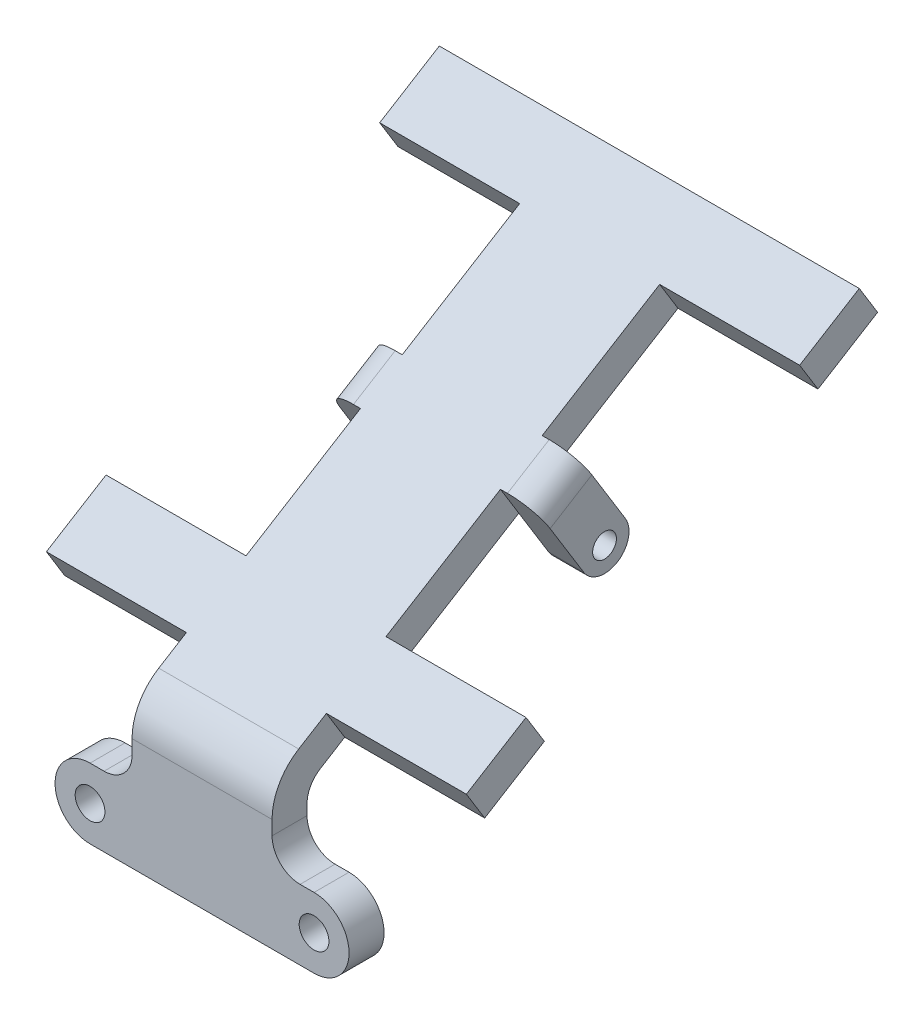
ISO-10303-21;
HEADER;
FILE_DESCRIPTION(('STEP AP214'),'2;1');
FILE_NAME('part.step','',(''),(''),'','','');
FILE_SCHEMA(('AUTOMOTIVE_DESIGN { 1 0 10303 214 1 1 1 1 }'));
ENDSEC;
DATA;
#1=APPLICATION_CONTEXT('core data for automotive mechanical design processes');
#2=APPLICATION_PROTOCOL_DEFINITION('international standard','automotive_design',2000,#1);
#3=PRODUCT_CONTEXT('',#1,'mechanical');
#4=PRODUCT('Part','Part','',(#3));
#5=PRODUCT_RELATED_PRODUCT_CATEGORY('part','',(#4));
#6=PRODUCT_DEFINITION_FORMATION('','',#4);
#7=PRODUCT_DEFINITION_CONTEXT('part definition',#1,'design');
#8=PRODUCT_DEFINITION('design','',#6,#7);
#9=PRODUCT_DEFINITION_SHAPE('','',#8);
#10=(LENGTH_UNIT() NAMED_UNIT(*) SI_UNIT(.MILLI.,.METRE.));
#11=(NAMED_UNIT(*) PLANE_ANGLE_UNIT() SI_UNIT($,.RADIAN.));
#12=(NAMED_UNIT(*) SI_UNIT($,.STERADIAN.) SOLID_ANGLE_UNIT());
#13=UNCERTAINTY_MEASURE_WITH_UNIT(LENGTH_MEASURE(1.E-05),#10,'distance_accuracy_value','');
#14=(GEOMETRIC_REPRESENTATION_CONTEXT(3) GLOBAL_UNCERTAINTY_ASSIGNED_CONTEXT((#13)) GLOBAL_UNIT_ASSIGNED_CONTEXT((#10,
#11,#12)) REPRESENTATION_CONTEXT('',''));
#15=CARTESIAN_POINT('',(0.,0.,0.));
#16=DIRECTION('',(0.,0.,1.));
#17=DIRECTION('',(1.,0.,0.));
#18=AXIS2_PLACEMENT_3D('',#15,#16,#17);
#19=CARTESIAN_POINT('',(-20.,86.6241666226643,10.));
#20=DIRECTION('',(1.,0.,0.));
#21=DIRECTION('',(0.,1.,0.));
#22=AXIS2_PLACEMENT_3D('',#19,#20,#21);
#23=PLANE('',#22);
#24=DIRECTION('',(0.,-0.523670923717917,0.851920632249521));
#25=VECTOR('',#24,1.);
#26=CARTESIAN_POINT('',(-20.,99.6241666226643,10.));
#27=LINE('',#26,#25);
#28=CARTESIAN_POINT('',(-20.,109.165805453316,-5.52257079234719));
#29=VERTEX_POINT('',#28);
#30=CARTESIAN_POINT('',(-20.,104.308916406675,2.37873477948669));
#31=VERTEX_POINT('',#30);
#32=EDGE_CURVE('E440',#29,#31,#27,.T.);
#33=ORIENTED_EDGE('',*,*,#32,.F.);
#34=DIRECTION('',(0.,-0.851920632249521,-0.523670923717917));
#35=VECTOR('',#34,1.);
#36=CARTESIAN_POINT('',(-20.,99.7308115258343,-11.3222096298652));
#37=LINE('',#36,#35);
#38=CARTESIAN_POINT('',(-20.,100.646599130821,-10.7592800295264));
#39=VERTEX_POINT('',#38);
#40=EDGE_CURVE('E361',#29,#39,#37,.T.);
#41=ORIENTED_EDGE('',*,*,#40,.T.);
#42=DIRECTION('',(0.,0.523670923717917,-0.851920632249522));
#43=VECTOR('',#42,1.);
#44=CARTESIAN_POINT('',(-20.,91.1049603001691,4.76329076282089));
#45=LINE('',#44,#43);
#46=CARTESIAN_POINT('',(-20.,96.3753038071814,-3.81063261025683));
#47=VERTEX_POINT('',#46);
#48=EDGE_CURVE('E445',#47,#39,#45,.T.);
#49=ORIENTED_EDGE('',*,*,#48,.F.);
#50=CARTESIAN_POINT('',(-20.,89.5599387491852,-8.00000000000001));
#51=DIRECTION('',(1.,0.,0.));
#52=DIRECTION('',(0.,1.,0.));
#53=AXIS2_PLACEMENT_3D('',#50,#51,#52);
#54=CIRCLE('',#53,8.);
#55=CARTESIAN_POINT('',(-20.,89.5599387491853,0.));
#56=VERTEX_POINT('',#55);
#57=EDGE_CURVE('E537',#47,#56,#54,.T.);
#58=ORIENTED_EDGE('',*,*,#57,.T.);
#59=DIRECTION('',(0.,-1.,0.));
#60=VECTOR('',#59,1.);
#61=CARTESIAN_POINT('',(-20.,86.6241666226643,1.11022302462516E-13));
#62=LINE('',#61,#60);
#63=CARTESIAN_POINT('',(-20.,86.6241666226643,1.11022302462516E-13));
#64=VERTEX_POINT('',#63);
#65=EDGE_CURVE('E482',#56,#64,#62,.T.);
#66=ORIENTED_EDGE('',*,*,#65,.T.);
#67=DIRECTION('',(0.,0.,-1.));
#68=VECTOR('',#67,1.);
#69=CARTESIAN_POINT('',(-20.,86.6241666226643,10.));
#70=LINE('',#69,#68);
#71=CARTESIAN_POINT('',(-20.,86.6241666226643,10.));
#72=VERTEX_POINT('',#71);
#73=EDGE_CURVE('E514',#72,#64,#70,.T.);
#74=ORIENTED_EDGE('',*,*,#73,.F.);
#75=DIRECTION('',(0.,-1.,0.));
#76=VECTOR('',#75,1.);
#77=CARTESIAN_POINT('',(-20.,86.6241666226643,10.));
#78=LINE('',#77,#76);
#79=CARTESIAN_POINT('',(-20.,90.6781862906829,10.));
#80=VERTEX_POINT('',#79);
#81=EDGE_CURVE('E502',#80,#72,#78,.T.);
#82=ORIENTED_EDGE('',*,*,#81,.F.);
#83=CARTESIAN_POINT('',(-20.,90.6781862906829,-6.00000000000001));
#84=DIRECTION('',(1.,0.,0.));
#85=DIRECTION('',(0.,1.,0.));
#86=AXIS2_PLACEMENT_3D('',#83,#84,#85);
#87=CIRCLE('',#86,16.);
#88=EDGE_CURVE('E544',#80,#31,#87,.F.);
#89=ORIENTED_EDGE('',*,*,#88,.T.);
#90=EDGE_LOOP('',(#33,#41,#49,#58,#66,#74,#82,#89));
#91=FACE_BOUND('',#90,.T.);
#92=ADVANCED_FACE('F32',(#91),#23,.F.);
#93=CARTESIAN_POINT('',(20.,86.6241666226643,10.));
#94=DIRECTION('',(-1.,0.,0.));
#95=DIRECTION('',(0.,-1.,0.));
#96=AXIS2_PLACEMENT_3D('',#93,#94,#95);
#97=PLANE('',#96);
#98=DIRECTION('',(0.,0.523670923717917,-0.851920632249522));
#99=VECTOR('',#98,1.);
#100=CARTESIAN_POINT('',(20.,91.104960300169,4.76329076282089));
#101=LINE('',#100,#99);
#102=CARTESIAN_POINT('',(20.,96.3753038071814,-3.81063261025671));
#103=VERTEX_POINT('',#102);
#104=CARTESIAN_POINT('',(20.,100.646599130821,-10.7592800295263));
#105=VERTEX_POINT('',#104);
#106=EDGE_CURVE('E453',#103,#105,#101,.T.);
#107=ORIENTED_EDGE('',*,*,#106,.T.);
#108=DIRECTION('',(0.,0.851920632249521,0.523670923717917));
#109=VECTOR('',#108,1.);
#110=CARTESIAN_POINT('',(20.,99.7308115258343,-11.3222096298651));
#111=LINE('',#110,#109);
#112=CARTESIAN_POINT('',(20.,109.165805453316,-5.52257079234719));
#113=VERTEX_POINT('',#112);
#114=EDGE_CURVE('E359',#105,#113,#111,.T.);
#115=ORIENTED_EDGE('',*,*,#114,.T.);
#116=DIRECTION('',(0.,-0.523670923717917,0.851920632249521));
#117=VECTOR('',#116,1.);
#118=CARTESIAN_POINT('',(20.,99.6241666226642,10.));
#119=LINE('',#118,#117);
#120=CARTESIAN_POINT('',(20.,104.308916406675,2.37873477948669));
#121=VERTEX_POINT('',#120);
#122=EDGE_CURVE('E448',#113,#121,#119,.T.);
#123=ORIENTED_EDGE('',*,*,#122,.T.);
#124=CARTESIAN_POINT('',(20.,90.6781862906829,-6.00000000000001));
#125=DIRECTION('',(-1.,0.,0.));
#126=DIRECTION('',(0.,-1.,0.));
#127=AXIS2_PLACEMENT_3D('',#124,#125,#126);
#128=CIRCLE('',#127,16.);
#129=CARTESIAN_POINT('',(20.,90.6781862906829,10.));
#130=VERTEX_POINT('',#129);
#131=EDGE_CURVE('E550',#121,#130,#128,.F.);
#132=ORIENTED_EDGE('',*,*,#131,.T.);
#133=DIRECTION('',(0.,1.,0.));
#134=VECTOR('',#133,1.);
#135=CARTESIAN_POINT('',(20.,86.6241666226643,10.));
#136=LINE('',#135,#134);
#137=CARTESIAN_POINT('',(20.,86.6241666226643,10.));
#138=VERTEX_POINT('',#137);
#139=EDGE_CURVE('E499',#138,#130,#136,.T.);
#140=ORIENTED_EDGE('',*,*,#139,.F.);
#141=DIRECTION('',(0.,0.,-1.));
#142=VECTOR('',#141,1.);
#143=CARTESIAN_POINT('',(20.,86.6241666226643,10.));
#144=LINE('',#143,#142);
#145=CARTESIAN_POINT('',(20.,86.6241666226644,0.));
#146=VERTEX_POINT('',#145);
#147=EDGE_CURVE('E517',#138,#146,#144,.T.);
#148=ORIENTED_EDGE('',*,*,#147,.T.);
#149=DIRECTION('',(0.,1.,0.));
#150=VECTOR('',#149,1.);
#151=CARTESIAN_POINT('',(20.,86.6241666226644,0.));
#152=LINE('',#151,#150);
#153=CARTESIAN_POINT('',(20.,89.5599387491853,0.));
#154=VERTEX_POINT('',#153);
#155=EDGE_CURVE('E479',#146,#154,#152,.T.);
#156=ORIENTED_EDGE('',*,*,#155,.T.);
#157=CARTESIAN_POINT('',(20.,89.5599387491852,-8.00000000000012));
#158=DIRECTION('',(-1.,0.,0.));
#159=DIRECTION('',(0.,-1.,0.));
#160=AXIS2_PLACEMENT_3D('',#157,#158,#159);
#161=CIRCLE('',#160,8.);
#162=EDGE_CURVE('E539',#154,#103,#161,.T.);
#163=ORIENTED_EDGE('',*,*,#162,.T.);
#164=EDGE_LOOP('',(#107,#115,#123,#132,#140,#148,#156,#163));
#165=FACE_BOUND('',#164,.T.);
#166=ADVANCED_FACE('F610',(#165),#97,.F.);
#167=CARTESIAN_POINT('',(20.,138.5532934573,-72.4268149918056));
#168=VERTEX_POINT('',#167);
#169=CARTESIAN_POINT('',(20.,159.182180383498,-105.986391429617));
#170=VERTEX_POINT('',#169);
#171=EDGE_CURVE('E47',#168,#170,#101,.T.);
#172=ORIENTED_EDGE('',*,*,#171,.T.);
#173=DIRECTION('',(0.,0.851920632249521,0.523670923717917));
#174=VECTOR('',#173,1.);
#175=CARTESIAN_POINT('',(20.0000000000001,158.266392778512,-106.549321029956));
#176=LINE('',#175,#174);
#177=CARTESIAN_POINT('',(20.,167.701386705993,-100.749682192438));
#178=VERTEX_POINT('',#177);
#179=EDGE_CURVE('E51',#170,#178,#176,.T.);
#180=ORIENTED_EDGE('',*,*,#179,.T.);
#181=CARTESIAN_POINT('',(20.,147.072499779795,-67.1901057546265));
#182=VERTEX_POINT('',#181);
#183=EDGE_CURVE('E450',#178,#182,#119,.T.);
#184=ORIENTED_EDGE('',*,*,#183,.T.);
#185=DIRECTION('',(0.,-0.851920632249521,-0.523670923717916));
#186=VECTOR('',#185,1.);
#187=CARTESIAN_POINT('',(19.9999999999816,124.665696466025,-80.9634444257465));
#188=LINE('',#187,#186);
#189=EDGE_CURVE('E374',#182,#168,#188,.T.);
#190=ORIENTED_EDGE('',*,*,#189,.T.);
#191=EDGE_LOOP('',(#172,#180,#184,#190));
#192=FACE_BOUND('',#191,.T.);
#193=ADVANCED_FACE('F684',(#192),#97,.F.);
#194=CARTESIAN_POINT('',(-20.,111.120017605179,-27.7976926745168));
#195=VERTEX_POINT('',#194);
#196=CARTESIAN_POINT('',(-20.,131.221900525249,-60.4999261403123));
#197=VERTEX_POINT('',#196);
#198=EDGE_CURVE('E449',#195,#197,#45,.T.);
#199=ORIENTED_EDGE('',*,*,#198,.F.);
#200=DIRECTION('',(0.,0.851920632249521,0.523670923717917));
#201=VECTOR('',#200,1.);
#202=CARTESIAN_POINT('',(-20.,110.204230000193,-28.3606222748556));
#203=LINE('',#202,#201);
#204=CARTESIAN_POINT('',(-20.,119.639223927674,-22.5609834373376));
#205=VERTEX_POINT('',#204);
#206=EDGE_CURVE('E356',#195,#205,#203,.T.);
#207=ORIENTED_EDGE('',*,*,#206,.T.);
#208=CARTESIAN_POINT('',(-20.,139.741106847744,-55.2632169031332));
#209=VERTEX_POINT('',#208);
#210=EDGE_CURVE('E444',#209,#205,#27,.T.);
#211=ORIENTED_EDGE('',*,*,#210,.F.);
#212=DIRECTION('',(0.,0.851920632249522,0.523670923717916));
#213=VECTOR('',#212,1.);
#214=CARTESIAN_POINT('',(-19.9999999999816,117.334303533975,-69.0365555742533));
#215=LINE('',#214,#213);
#216=EDGE_CURVE('E410',#197,#209,#215,.T.);
#217=ORIENTED_EDGE('',*,*,#216,.F.);
#218=EDGE_LOOP('',(#199,#207,#211,#217));
#219=FACE_BOUND('',#218,.T.);
#220=ADVANCED_FACE('F594',(#219),#23,.F.);
#221=CARTESIAN_POINT('',(-19.9999999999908,167.701386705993,-100.749682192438));
#222=VERTEX_POINT('',#221);
#223=CARTESIAN_POINT('',(-19.9999999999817,147.072499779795,-67.1901057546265));
#224=VERTEX_POINT('',#223);
#225=EDGE_CURVE('E441',#222,#224,#27,.T.);
#226=ORIENTED_EDGE('',*,*,#225,.F.);
#227=DIRECTION('',(0.,-0.851920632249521,-0.523670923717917));
#228=VECTOR('',#227,1.);
#229=CARTESIAN_POINT('',(-20.,158.266392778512,-106.549321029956));
#230=LINE('',#229,#228);
#231=CARTESIAN_POINT('',(-20.,159.182180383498,-105.986391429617));
#232=VERTEX_POINT('',#231);
#233=EDGE_CURVE('E314',#222,#232,#230,.T.);
#234=ORIENTED_EDGE('',*,*,#233,.T.);
#235=CARTESIAN_POINT('',(-19.9999999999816,138.5532934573,-72.4268149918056));
#236=VERTEX_POINT('',#235);
#237=EDGE_CURVE('E443',#236,#232,#45,.T.);
#238=ORIENTED_EDGE('',*,*,#237,.F.);
#239=DIRECTION('',(0.,-0.851920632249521,-0.523670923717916));
#240=VECTOR('',#239,1.);
#241=CARTESIAN_POINT('',(-19.9999999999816,124.665696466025,-80.9634444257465));
#242=LINE('',#241,#240);
#243=EDGE_CURVE('E415',#224,#236,#242,.T.);
#244=ORIENTED_EDGE('',*,*,#243,.F.);
#245=EDGE_LOOP('',(#226,#234,#238,#244));
#246=FACE_BOUND('',#245,.T.);
#247=ADVANCED_FACE('F701',(#246),#23,.F.);
#248=CARTESIAN_POINT('',(-31.9999999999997,68.6241666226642,0.));
#249=DIRECTION('',(0.,0.,1.));
#250=DIRECTION('',(1.,0.,0.));
#251=AXIS2_PLACEMENT_3D('',#248,#249,#250);
#252=PLANE('',#251);
#253=CARTESIAN_POINT('',(31.9999999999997,68.6241666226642,0.));
#254=DIRECTION('',(0.,0.,1.));
#255=DIRECTION('',(1.,0.,0.));
#256=AXIS2_PLACEMENT_3D('',#253,#254,#255);
#257=CIRCLE('',#256,4.25000000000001);
#258=CARTESIAN_POINT('',(36.2499999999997,68.6241666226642,0.));
#259=VERTEX_POINT('',#258);
#260=EDGE_CURVE('E284',#259,#259,#257,.T.);
#261=ORIENTED_EDGE('',*,*,#260,.T.);
#262=EDGE_LOOP('',(#261));
#263=FACE_BOUND('',#262,.T.);
#264=CARTESIAN_POINT('',(-31.9999999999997,68.6241666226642,0.));
#265=DIRECTION('',(0.,0.,1.));
#266=DIRECTION('',(1.,0.,0.));
#267=AXIS2_PLACEMENT_3D('',#264,#265,#266);
#268=CIRCLE('',#267,4.25000000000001);
#269=CARTESIAN_POINT('',(-27.7499999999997,68.6241666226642,0.));
#270=VERTEX_POINT('',#269);
#271=EDGE_CURVE('E462',#270,#270,#268,.T.);
#272=ORIENTED_EDGE('',*,*,#271,.T.);
#273=EDGE_LOOP('',(#272));
#274=FACE_BOUND('',#273,.T.);
#275=ORIENTED_EDGE('',*,*,#65,.F.);
#276=DIRECTION('',(-1.,0.,0.));
#277=VECTOR('',#276,1.);
#278=CARTESIAN_POINT('',(20.,89.5599387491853,0.));
#279=LINE('',#278,#277);
#280=EDGE_CURVE('E535',#56,#154,#279,.F.);
#281=ORIENTED_EDGE('',*,*,#280,.T.);
#282=ORIENTED_EDGE('',*,*,#155,.F.);
#283=CARTESIAN_POINT('',(28.,86.6241666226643,1.11022302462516E-13));
#284=DIRECTION('',(0.,0.,-1.));
#285=DIRECTION('',(-1.,0.,0.));
#286=AXIS2_PLACEMENT_3D('',#283,#284,#285);
#287=CIRCLE('',#286,8.);
#288=CARTESIAN_POINT('',(28.0000000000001,78.6241666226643,-1.11022302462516E-13));
#289=VERTEX_POINT('',#288);
#290=EDGE_CURVE('E477',#289,#146,#287,.T.);
#291=ORIENTED_EDGE('',*,*,#290,.F.);
#292=DIRECTION('',(-1.,0.,0.));
#293=VECTOR('',#292,1.);
#294=CARTESIAN_POINT('',(31.9999999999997,78.6241666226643,0.));
#295=LINE('',#294,#293);
#296=CARTESIAN_POINT('',(31.9999999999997,78.6241666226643,0.));
#297=VERTEX_POINT('',#296);
#298=EDGE_CURVE('E475',#297,#289,#295,.T.);
#299=ORIENTED_EDGE('',*,*,#298,.F.);
#300=CARTESIAN_POINT('',(31.9999999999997,68.6241666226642,0.));
#301=DIRECTION('',(0.,0.,1.));
#302=DIRECTION('',(1.,0.,0.));
#303=AXIS2_PLACEMENT_3D('',#300,#301,#302);
#304=CIRCLE('',#303,9.99999999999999);
#305=CARTESIAN_POINT('',(31.9999999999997,58.6241666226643,0.));
#306=VERTEX_POINT('',#305);
#307=EDGE_CURVE('E473',#306,#297,#304,.T.);
#308=ORIENTED_EDGE('',*,*,#307,.F.);
#309=DIRECTION('',(1.,0.,0.));
#310=VECTOR('',#309,1.);
#311=CARTESIAN_POINT('',(26.4999999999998,58.6241666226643,0.));
#312=LINE('',#311,#310);
#313=CARTESIAN_POINT('',(-31.9999999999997,58.6241666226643,1.11022302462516E-13));
#314=VERTEX_POINT('',#313);
#315=EDGE_CURVE('E471',#314,#306,#312,.T.);
#316=ORIENTED_EDGE('',*,*,#315,.F.);
#317=CARTESIAN_POINT('',(-31.9999999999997,68.6241666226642,0.));
#318=DIRECTION('',(0.,0.,1.));
#319=DIRECTION('',(1.,0.,0.));
#320=AXIS2_PLACEMENT_3D('',#317,#318,#319);
#321=CIRCLE('',#320,9.99999999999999);
#322=CARTESIAN_POINT('',(-31.9999999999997,78.6241666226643,-1.11022302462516E-13));
#323=VERTEX_POINT('',#322);
#324=EDGE_CURVE('E468',#323,#314,#321,.T.);
#325=ORIENTED_EDGE('',*,*,#324,.F.);
#326=DIRECTION('',(-1.,0.,0.));
#327=VECTOR('',#326,1.);
#328=CARTESIAN_POINT('',(-28.0000000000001,78.6241666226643,-1.11022302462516E-13));
#329=LINE('',#328,#327);
#330=CARTESIAN_POINT('',(-28.0000000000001,78.6241666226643,-1.11022302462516E-13));
#331=VERTEX_POINT('',#330);
#332=EDGE_CURVE('E486',#331,#323,#329,.T.);
#333=ORIENTED_EDGE('',*,*,#332,.F.);
#334=CARTESIAN_POINT('',(-28.,86.6241666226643,0.));
#335=DIRECTION('',(0.,0.,-1.));
#336=DIRECTION('',(1.,0.,0.));
#337=AXIS2_PLACEMENT_3D('',#334,#335,#336);
#338=CIRCLE('',#337,8.);
#339=EDGE_CURVE('E484',#64,#331,#338,.T.);
#340=ORIENTED_EDGE('',*,*,#339,.F.);
#341=EDGE_LOOP('',(#275,#281,#282,#291,#299,#308,#316,#325,#333,#340));
#342=FACE_BOUND('',#341,.T.);
#343=ADVANCED_FACE('F625',(#263,#274,#342),#252,.F.);
#344=CARTESIAN_POINT('',(-31.9999999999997,68.6241666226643,9.9999999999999));
#345=DIRECTION('',(0.,0.,1.));
#346=DIRECTION('',(1.,0.,0.));
#347=AXIS2_PLACEMENT_3D('',#344,#345,#346);
#348=PLANE('',#347);
#349=CARTESIAN_POINT('',(-31.9999999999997,68.6241666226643,9.9999999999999));
#350=DIRECTION('',(0.,0.,1.));
#351=DIRECTION('',(1.,0.,0.));
#352=AXIS2_PLACEMENT_3D('',#349,#350,#351);
#353=CIRCLE('',#352,4.25000000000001);
#354=CARTESIAN_POINT('',(-27.7499999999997,68.6241666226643,9.9999999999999));
#355=VERTEX_POINT('',#354);
#356=EDGE_CURVE('E465',#355,#355,#353,.T.);
#357=ORIENTED_EDGE('',*,*,#356,.F.);
#358=EDGE_LOOP('',(#357));
#359=FACE_BOUND('',#358,.T.);
#360=ORIENTED_EDGE('',*,*,#139,.T.);
#361=DIRECTION('',(-1.,0.,0.));
#362=VECTOR('',#361,1.);
#363=CARTESIAN_POINT('',(-20.,90.6781862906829,10.));
#364=LINE('',#363,#362);
#365=EDGE_CURVE('E541',#130,#80,#364,.T.);
#366=ORIENTED_EDGE('',*,*,#365,.T.);
#367=ORIENTED_EDGE('',*,*,#81,.T.);
#368=CARTESIAN_POINT('',(-28.,86.6241666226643,9.9999999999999));
#369=DIRECTION('',(0.,0.,-1.));
#370=DIRECTION('',(1.,0.,0.));
#371=AXIS2_PLACEMENT_3D('',#368,#369,#370);
#372=CIRCLE('',#371,8.);
#373=CARTESIAN_POINT('',(-28.0000000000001,78.6241666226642,10.));
#374=VERTEX_POINT('',#373);
#375=EDGE_CURVE('E504',#72,#374,#372,.T.);
#376=ORIENTED_EDGE('',*,*,#375,.T.);
#377=DIRECTION('',(-1.,0.,0.));
#378=VECTOR('',#377,1.);
#379=CARTESIAN_POINT('',(-28.0000000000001,78.6241666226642,10.));
#380=LINE('',#379,#378);
#381=CARTESIAN_POINT('',(-31.9999999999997,78.6241666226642,10.));
#382=VERTEX_POINT('',#381);
#383=EDGE_CURVE('E506',#374,#382,#380,.T.);
#384=ORIENTED_EDGE('',*,*,#383,.T.);
#385=CARTESIAN_POINT('',(-31.9999999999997,68.6241666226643,9.9999999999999));
#386=DIRECTION('',(0.,0.,1.));
#387=DIRECTION('',(1.,0.,0.));
#388=AXIS2_PLACEMENT_3D('',#385,#386,#387);
#389=CIRCLE('',#388,9.99999999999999);
#390=CARTESIAN_POINT('',(-31.9999999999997,58.6241666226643,10.));
#391=VERTEX_POINT('',#390);
#392=EDGE_CURVE('E488',#382,#391,#389,.T.);
#393=ORIENTED_EDGE('',*,*,#392,.T.);
#394=DIRECTION('',(1.,0.,0.));
#395=VECTOR('',#394,1.);
#396=CARTESIAN_POINT('',(-31.9999999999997,58.6241666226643,10.));
#397=LINE('',#396,#395);
#398=CARTESIAN_POINT('',(31.9999999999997,58.6241666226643,10.));
#399=VERTEX_POINT('',#398);
#400=EDGE_CURVE('E491',#391,#399,#397,.T.);
#401=ORIENTED_EDGE('',*,*,#400,.T.);
#402=CARTESIAN_POINT('',(31.9999999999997,68.6241666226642,9.9999999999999));
#403=DIRECTION('',(0.,0.,1.));
#404=DIRECTION('',(1.,0.,0.));
#405=AXIS2_PLACEMENT_3D('',#402,#403,#404);
#406=CIRCLE('',#405,9.99999999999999);
#407=CARTESIAN_POINT('',(31.9999999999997,78.6241666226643,10.));
#408=VERTEX_POINT('',#407);
#409=EDGE_CURVE('E493',#399,#408,#406,.T.);
#410=ORIENTED_EDGE('',*,*,#409,.T.);
#411=DIRECTION('',(-1.,0.,0.));
#412=VECTOR('',#411,1.);
#413=CARTESIAN_POINT('',(31.9999999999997,78.6241666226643,10.));
#414=LINE('',#413,#412);
#415=CARTESIAN_POINT('',(28.0000000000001,78.6241666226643,10.));
#416=VERTEX_POINT('',#415);
#417=EDGE_CURVE('E495',#408,#416,#414,.T.);
#418=ORIENTED_EDGE('',*,*,#417,.T.);
#419=CARTESIAN_POINT('',(28.,86.6241666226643,10.));
#420=DIRECTION('',(0.,0.,-1.));
#421=DIRECTION('',(-1.,0.,0.));
#422=AXIS2_PLACEMENT_3D('',#419,#420,#421);
#423=CIRCLE('',#422,8.);
#424=EDGE_CURVE('E497',#416,#138,#423,.T.);
#425=ORIENTED_EDGE('',*,*,#424,.T.);
#426=EDGE_LOOP('',(#360,#366,#367,#376,#384,#393,#401,#410,#418,#425));
#427=FACE_BOUND('',#426,.T.);
#428=CARTESIAN_POINT('',(31.9999999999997,68.6241666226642,9.9999999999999));
#429=DIRECTION('',(0.,0.,1.));
#430=DIRECTION('',(1.,0.,0.));
#431=AXIS2_PLACEMENT_3D('',#428,#429,#430);
#432=CIRCLE('',#431,4.25000000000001);
#433=CARTESIAN_POINT('',(36.2499999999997,68.6241666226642,9.9999999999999));
#434=VERTEX_POINT('',#433);
#435=EDGE_CURVE('E459',#434,#434,#432,.T.);
#436=ORIENTED_EDGE('',*,*,#435,.F.);
#437=EDGE_LOOP('',(#436));
#438=FACE_BOUND('',#437,.T.);
#439=ADVANCED_FACE('F612',(#359,#427,#438),#348,.T.);
#440=CARTESIAN_POINT('',(-31.9999999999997,68.6241666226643,9.9999999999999));
#441=DIRECTION('',(0.,0.,-1.));
#442=DIRECTION('',(-1.,0.,0.));
#443=AXIS2_PLACEMENT_3D('',#440,#441,#442);
#444=CYLINDRICAL_SURFACE('',#443,9.99999999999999);
#445=ORIENTED_EDGE('',*,*,#324,.T.);
#446=DIRECTION('',(0.,0.,-1.));
#447=VECTOR('',#446,1.);
#448=CARTESIAN_POINT('',(-31.9999999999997,58.6241666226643,10.));
#449=LINE('',#448,#447);
#450=EDGE_CURVE('E529',#391,#314,#449,.T.);
#451=ORIENTED_EDGE('',*,*,#450,.F.);
#452=ORIENTED_EDGE('',*,*,#392,.F.);
#453=DIRECTION('',(0.,0.,-1.));
#454=VECTOR('',#453,1.);
#455=CARTESIAN_POINT('',(-31.9999999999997,78.6241666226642,10.));
#456=LINE('',#455,#454);
#457=EDGE_CURVE('E508',#382,#323,#456,.T.);
#458=ORIENTED_EDGE('',*,*,#457,.T.);
#459=EDGE_LOOP('',(#445,#451,#452,#458));
#460=FACE_BOUND('',#459,.T.);
#461=ADVANCED_FACE('F34',(#460),#444,.T.);
#462=CARTESIAN_POINT('',(26.4999999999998,58.6241666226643,10.));
#463=DIRECTION('',(0.,1.,0.));
#464=DIRECTION('',(-1.,0.,0.));
#465=AXIS2_PLACEMENT_3D('',#462,#463,#464);
#466=PLANE('',#465);
#467=ORIENTED_EDGE('',*,*,#315,.T.);
#468=DIRECTION('',(0.,0.,-1.));
#469=VECTOR('',#468,1.);
#470=CARTESIAN_POINT('',(31.9999999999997,58.6241666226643,10.));
#471=LINE('',#470,#469);
#472=EDGE_CURVE('E526',#399,#306,#471,.T.);
#473=ORIENTED_EDGE('',*,*,#472,.F.);
#474=ORIENTED_EDGE('',*,*,#400,.F.);
#475=ORIENTED_EDGE('',*,*,#450,.T.);
#476=EDGE_LOOP('',(#467,#473,#474,#475));
#477=FACE_BOUND('',#476,.T.);
#478=ADVANCED_FACE('F747',(#477),#466,.F.);
#479=CARTESIAN_POINT('',(31.9999999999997,68.6241666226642,9.9999999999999));
#480=DIRECTION('',(0.,0.,-1.));
#481=DIRECTION('',(-1.,0.,0.));
#482=AXIS2_PLACEMENT_3D('',#479,#480,#481);
#483=CYLINDRICAL_SURFACE('',#482,9.99999999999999);
#484=ORIENTED_EDGE('',*,*,#307,.T.);
#485=DIRECTION('',(0.,0.,-1.));
#486=VECTOR('',#485,1.);
#487=CARTESIAN_POINT('',(31.9999999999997,78.6241666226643,10.));
#488=LINE('',#487,#486);
#489=EDGE_CURVE('E523',#408,#297,#488,.T.);
#490=ORIENTED_EDGE('',*,*,#489,.F.);
#491=ORIENTED_EDGE('',*,*,#409,.F.);
#492=ORIENTED_EDGE('',*,*,#472,.T.);
#493=EDGE_LOOP('',(#484,#490,#491,#492));
#494=FACE_BOUND('',#493,.T.);
#495=ADVANCED_FACE('F742',(#494),#483,.T.);
#496=CARTESIAN_POINT('',(31.9999999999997,78.6241666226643,10.));
#497=DIRECTION('',(0.,-1.,0.));
#498=DIRECTION('',(0.,0.,-1.));
#499=AXIS2_PLACEMENT_3D('',#496,#497,#498);
#500=PLANE('',#499);
#501=ORIENTED_EDGE('',*,*,#298,.T.);
#502=DIRECTION('',(0.,0.,-1.));
#503=VECTOR('',#502,1.);
#504=CARTESIAN_POINT('',(28.0000000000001,78.6241666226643,10.));
#505=LINE('',#504,#503);
#506=EDGE_CURVE('E520',#416,#289,#505,.T.);
#507=ORIENTED_EDGE('',*,*,#506,.F.);
#508=ORIENTED_EDGE('',*,*,#417,.F.);
#509=ORIENTED_EDGE('',*,*,#489,.T.);
#510=EDGE_LOOP('',(#501,#507,#508,#509));
#511=FACE_BOUND('',#510,.T.);
#512=ADVANCED_FACE('F738',(#511),#500,.F.);
#513=CARTESIAN_POINT('',(28.,86.6241666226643,10.));
#514=DIRECTION('',(0.,0.,-1.));
#515=DIRECTION('',(-1.,0.,0.));
#516=AXIS2_PLACEMENT_3D('',#513,#514,#515);
#517=CYLINDRICAL_SURFACE('',#516,8.);
#518=ORIENTED_EDGE('',*,*,#290,.T.);
#519=ORIENTED_EDGE('',*,*,#147,.F.);
#520=ORIENTED_EDGE('',*,*,#424,.F.);
#521=ORIENTED_EDGE('',*,*,#506,.T.);
#522=EDGE_LOOP('',(#518,#519,#520,#521));
#523=FACE_BOUND('',#522,.T.);
#524=ADVANCED_FACE('F619',(#523),#517,.F.);
#525=CARTESIAN_POINT('',(19.9999999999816,139.741106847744,-55.2632169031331));
#526=VERTEX_POINT('',#525);
#527=CARTESIAN_POINT('',(20.,119.639223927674,-22.5609834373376));
#528=VERTEX_POINT('',#527);
#529=EDGE_CURVE('E452',#526,#528,#119,.T.);
#530=ORIENTED_EDGE('',*,*,#529,.T.);
#531=DIRECTION('',(0.,-0.851920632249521,-0.523670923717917));
#532=VECTOR('',#531,1.);
#533=CARTESIAN_POINT('',(20.,110.204230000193,-28.3606222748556));
#534=LINE('',#533,#532);
#535=CARTESIAN_POINT('',(20.,111.120017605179,-27.7976926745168));
#536=VERTEX_POINT('',#535);
#537=EDGE_CURVE('E353',#528,#536,#534,.T.);
#538=ORIENTED_EDGE('',*,*,#537,.T.);
#539=CARTESIAN_POINT('',(20.,131.221900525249,-60.4999261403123));
#540=VERTEX_POINT('',#539);
#541=EDGE_CURVE('E455',#536,#540,#101,.T.);
#542=ORIENTED_EDGE('',*,*,#541,.T.);
#543=DIRECTION('',(0.,0.851920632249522,0.523670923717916));
#544=VECTOR('',#543,1.);
#545=CARTESIAN_POINT('',(19.9999999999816,117.334303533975,-69.0365555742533));
#546=LINE('',#545,#544);
#547=EDGE_CURVE('E376',#540,#526,#546,.T.);
#548=ORIENTED_EDGE('',*,*,#547,.T.);
#549=EDGE_LOOP('',(#530,#538,#542,#548));
#550=FACE_BOUND('',#549,.T.);
#551=ADVANCED_FACE('F653',(#550),#97,.F.);
#552=CARTESIAN_POINT('',(-28.,86.6241666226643,9.9999999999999));
#553=DIRECTION('',(0.,0.,-1.));
#554=DIRECTION('',(-1.,0.,0.));
#555=AXIS2_PLACEMENT_3D('',#552,#553,#554);
#556=CYLINDRICAL_SURFACE('',#555,8.);
#557=ORIENTED_EDGE('',*,*,#339,.T.);
#558=DIRECTION('',(0.,0.,-1.));
#559=VECTOR('',#558,1.);
#560=CARTESIAN_POINT('',(-28.0000000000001,78.6241666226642,10.));
#561=LINE('',#560,#559);
#562=EDGE_CURVE('E511',#374,#331,#561,.T.);
#563=ORIENTED_EDGE('',*,*,#562,.F.);
#564=ORIENTED_EDGE('',*,*,#375,.F.);
#565=ORIENTED_EDGE('',*,*,#73,.T.);
#566=EDGE_LOOP('',(#557,#563,#564,#565));
#567=FACE_BOUND('',#566,.T.);
#568=ADVANCED_FACE('F731',(#567),#556,.F.);
#569=CARTESIAN_POINT('',(-28.0000000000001,78.6241666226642,10.));
#570=DIRECTION('',(0.,-1.,0.));
#571=DIRECTION('',(0.,0.,-1.));
#572=AXIS2_PLACEMENT_3D('',#569,#570,#571);
#573=PLANE('',#572);
#574=ORIENTED_EDGE('',*,*,#332,.T.);
#575=ORIENTED_EDGE('',*,*,#457,.F.);
#576=ORIENTED_EDGE('',*,*,#383,.F.);
#577=ORIENTED_EDGE('',*,*,#562,.T.);
#578=EDGE_LOOP('',(#574,#575,#576,#577));
#579=FACE_BOUND('',#578,.T.);
#580=ADVANCED_FACE('F736',(#579),#573,.F.);
#581=CARTESIAN_POINT('',(-31.9999999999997,68.6241666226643,9.9999999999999));
#582=DIRECTION('',(0.,0.,-1.));
#583=DIRECTION('',(-1.,0.,0.));
#584=AXIS2_PLACEMENT_3D('',#581,#582,#583);
#585=CYLINDRICAL_SURFACE('',#584,4.25000000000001);
#586=ORIENTED_EDGE('',*,*,#356,.T.);
#587=EDGE_LOOP('',(#586));
#588=FACE_BOUND('',#587,.T.);
#589=ORIENTED_EDGE('',*,*,#271,.F.);
#590=EDGE_LOOP('',(#589));
#591=FACE_BOUND('',#590,.T.);
#592=ADVANCED_FACE('F840',(#588,#591),#585,.F.);
#593=CARTESIAN_POINT('',(31.9999999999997,68.6241666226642,9.9999999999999));
#594=DIRECTION('',(0.,0.,-1.));
#595=DIRECTION('',(-1.,0.,0.));
#596=AXIS2_PLACEMENT_3D('',#593,#594,#595);
#597=CYLINDRICAL_SURFACE('',#596,4.25000000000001);
#598=ORIENTED_EDGE('',*,*,#435,.T.);
#599=EDGE_LOOP('',(#598));
#600=FACE_BOUND('',#599,.T.);
#601=ORIENTED_EDGE('',*,*,#260,.F.);
#602=EDGE_LOOP('',(#601));
#603=FACE_BOUND('',#602,.T.);
#604=ADVANCED_FACE('F833',(#600,#603),#597,.F.);
#605=CARTESIAN_POINT('',(20.,91.104960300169,4.76329076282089));
#606=DIRECTION('',(0.,0.851920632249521,0.523670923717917));
#607=DIRECTION('',(0.,-0.523670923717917,0.851920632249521));
#608=AXIS2_PLACEMENT_3D('',#605,#606,#607);
#609=PLANE('',#608);
#610=ORIENTED_EDGE('',*,*,#237,.T.);
#611=DIRECTION('',(-1.,0.,0.));
#612=VECTOR('',#611,1.);
#613=CARTESIAN_POINT('',(60.,159.182180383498,-105.986391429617));
#614=LINE('',#613,#612);
#615=CARTESIAN_POINT('',(-60.,159.182180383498,-105.986391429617));
#616=VERTEX_POINT('',#615);
#617=EDGE_CURVE('E689',#232,#616,#614,.T.);
#618=ORIENTED_EDGE('',*,*,#617,.T.);
#619=DIRECTION('',(0.,0.523670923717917,-0.851920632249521));
#620=VECTOR('',#619,1.);
#621=CARTESIAN_POINT('',(-60.,159.182180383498,-105.986391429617));
#622=LINE('',#621,#620);
#623=CARTESIAN_POINT('',(-60.,169.655598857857,-123.024804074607));
#624=VERTEX_POINT('',#623);
#625=EDGE_CURVE('E310',#616,#624,#622,.T.);
#626=ORIENTED_EDGE('',*,*,#625,.T.);
#627=DIRECTION('',(-1.,0.,0.));
#628=VECTOR('',#627,1.);
#629=CARTESIAN_POINT('',(20.,169.655598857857,-123.024804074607));
#630=LINE('',#629,#628);
#631=CARTESIAN_POINT('',(60.,169.655598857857,-123.024804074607));
#632=VERTEX_POINT('',#631);
#633=EDGE_CURVE('E285',#632,#624,#630,.T.);
#634=ORIENTED_EDGE('',*,*,#633,.F.);
#635=DIRECTION('',(0.,-0.523670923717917,0.851920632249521));
#636=VECTOR('',#635,1.);
#637=CARTESIAN_POINT('',(60.,159.182180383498,-105.986391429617));
#638=LINE('',#637,#636);
#639=CARTESIAN_POINT('',(60.,159.182180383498,-105.986391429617));
#640=VERTEX_POINT('',#639);
#641=EDGE_CURVE('E293',#632,#640,#638,.T.);
#642=ORIENTED_EDGE('',*,*,#641,.T.);
#643=EDGE_CURVE('E688',#640,#170,#614,.T.);
#644=ORIENTED_EDGE('',*,*,#643,.T.);
#645=ORIENTED_EDGE('',*,*,#171,.F.);
#646=DIRECTION('',(0.,0.523670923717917,-0.851920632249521));
#647=VECTOR('',#646,1.);
#648=CARTESIAN_POINT('',(19.9999999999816,91.104960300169,4.76329076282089));
#649=LINE('',#648,#647);
#650=EDGE_CURVE('E398',#540,#168,#649,.T.);
#651=ORIENTED_EDGE('',*,*,#650,.F.);
#652=ORIENTED_EDGE('',*,*,#541,.F.);
#653=DIRECTION('',(1.,0.,0.));
#654=VECTOR('',#653,1.);
#655=CARTESIAN_POINT('',(60.,111.120017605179,-27.7976926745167));
#656=LINE('',#655,#654);
#657=CARTESIAN_POINT('',(60.,111.120017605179,-27.7976926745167));
#658=VERTEX_POINT('',#657);
#659=EDGE_CURVE('E328',#536,#658,#656,.T.);
#660=ORIENTED_EDGE('',*,*,#659,.T.);
#661=DIRECTION('',(0.,-0.523670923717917,0.851920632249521));
#662=VECTOR('',#661,1.);
#663=CARTESIAN_POINT('',(60.,100.646599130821,-10.7592800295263));
#664=LINE('',#663,#662);
#665=CARTESIAN_POINT('',(60.,100.646599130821,-10.7592800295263));
#666=VERTEX_POINT('',#665);
#667=EDGE_CURVE('E326',#658,#666,#664,.T.);
#668=ORIENTED_EDGE('',*,*,#667,.T.);
#669=DIRECTION('',(-1.,0.,0.));
#670=VECTOR('',#669,1.);
#671=CARTESIAN_POINT('',(60.,100.646599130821,-10.7592800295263));
#672=LINE('',#671,#670);
#673=EDGE_CURVE('E323',#666,#105,#672,.T.);
#674=ORIENTED_EDGE('',*,*,#673,.T.);
#675=ORIENTED_EDGE('',*,*,#106,.F.);
#676=DIRECTION('',(-1.,0.,0.));
#677=VECTOR('',#676,1.);
#678=CARTESIAN_POINT('',(-20.,96.3753038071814,-3.81063261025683));
#679=LINE('',#678,#677);
#680=EDGE_CURVE('E532',#103,#47,#679,.T.);
#681=ORIENTED_EDGE('',*,*,#680,.T.);
#682=ORIENTED_EDGE('',*,*,#48,.T.);
#683=CARTESIAN_POINT('',(-60.,100.646599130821,-10.7592800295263));
#684=VERTEX_POINT('',#683);
#685=EDGE_CURVE('E321',#39,#684,#672,.T.);
#686=ORIENTED_EDGE('',*,*,#685,.T.);
#687=DIRECTION('',(0.,0.523670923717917,-0.851920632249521));
#688=VECTOR('',#687,1.);
#689=CARTESIAN_POINT('',(-60.,100.646599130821,-10.7592800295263));
#690=LINE('',#689,#688);
#691=CARTESIAN_POINT('',(-60.,111.120017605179,-27.7976926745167));
#692=VERTEX_POINT('',#691);
#693=EDGE_CURVE('E319',#684,#692,#690,.T.);
#694=ORIENTED_EDGE('',*,*,#693,.T.);
#695=EDGE_CURVE('E351',#692,#195,#656,.T.);
#696=ORIENTED_EDGE('',*,*,#695,.T.);
#697=ORIENTED_EDGE('',*,*,#198,.T.);
#698=DIRECTION('',(0.,-0.523670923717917,0.851920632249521));
#699=VECTOR('',#698,1.);
#700=CARTESIAN_POINT('',(-19.9999999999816,91.1049603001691,4.76329076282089));
#701=LINE('',#700,#699);
#702=EDGE_CURVE('E437',#236,#197,#701,.T.);
#703=ORIENTED_EDGE('',*,*,#702,.F.);
#704=EDGE_LOOP('',(#610,#618,#626,#634,#642,#644,#645,#651,#652,#660,#668,#674,#675,#681,#682,
#686,#694,#696,#697,#703));
#705=FACE_BOUND('',#704,.T.);
#706=ADVANCED_FACE('F636',(#705),#609,.F.);
#707=CARTESIAN_POINT('',(20.,169.655598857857,-123.024804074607));
#708=DIRECTION('',(0.,-0.523670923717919,0.85192063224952));
#709=DIRECTION('',(0.,-0.85192063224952,-0.523670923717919));
#710=AXIS2_PLACEMENT_3D('',#707,#708,#709);
#711=PLANE('',#710);
#712=ORIENTED_EDGE('',*,*,#633,.T.);
#713=DIRECTION('',(0.,0.851920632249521,0.523670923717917));
#714=VECTOR('',#713,1.);
#715=CARTESIAN_POINT('',(-60.,66.0149808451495,-186.732121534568));
#716=LINE('',#715,#714);
#717=CARTESIAN_POINT('',(-60.,178.174805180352,-117.788094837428));
#718=VERTEX_POINT('',#717);
#719=EDGE_CURVE('E279',#624,#718,#716,.T.);
#720=ORIENTED_EDGE('',*,*,#719,.T.);
#721=DIRECTION('',(-1.,0.,0.));
#722=VECTOR('',#721,1.);
#723=CARTESIAN_POINT('',(20.,178.174805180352,-117.788094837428));
#724=LINE('',#723,#722);
#725=CARTESIAN_POINT('',(60.,178.174805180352,-117.788094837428));
#726=VERTEX_POINT('',#725);
#727=EDGE_CURVE('E274',#726,#718,#724,.T.);
#728=ORIENTED_EDGE('',*,*,#727,.F.);
#729=DIRECTION('',(0.,0.851920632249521,0.523670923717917));
#730=VECTOR('',#729,1.);
#731=CARTESIAN_POINT('',(60.,66.0149808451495,-186.732121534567));
#732=LINE('',#731,#730);
#733=EDGE_CURVE('E277',#632,#726,#732,.T.);
#734=ORIENTED_EDGE('',*,*,#733,.F.);
#735=EDGE_LOOP('',(#712,#720,#728,#734));
#736=FACE_BOUND('',#735,.T.);
#737=ADVANCED_FACE('F276',(#736),#711,.F.);
#738=CARTESIAN_POINT('',(20.,99.6241666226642,10.));
#739=DIRECTION('',(0.,-0.851920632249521,-0.523670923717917));
#740=DIRECTION('',(0.,0.523670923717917,-0.851920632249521));
#741=AXIS2_PLACEMENT_3D('',#738,#739,#740);
#742=PLANE('',#741);
#743=ORIENTED_EDGE('',*,*,#183,.F.);
#744=DIRECTION('',(1.,0.,0.));
#745=VECTOR('',#744,1.);
#746=CARTESIAN_POINT('',(60.,167.701386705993,-100.749682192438));
#747=LINE('',#746,#745);
#748=CARTESIAN_POINT('',(60.,167.701386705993,-100.749682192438));
#749=VERTEX_POINT('',#748);
#750=EDGE_CURVE('E298',#178,#749,#747,.T.);
#751=ORIENTED_EDGE('',*,*,#750,.T.);
#752=DIRECTION('',(0.,0.523670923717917,-0.851920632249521));
#753=VECTOR('',#752,1.);
#754=CARTESIAN_POINT('',(60.,167.701386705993,-100.749682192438));
#755=LINE('',#754,#753);
#756=EDGE_CURVE('E292',#749,#726,#755,.T.);
#757=ORIENTED_EDGE('',*,*,#756,.T.);
#758=ORIENTED_EDGE('',*,*,#727,.T.);
#759=DIRECTION('',(0.,-0.523670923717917,0.851920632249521));
#760=VECTOR('',#759,1.);
#761=CARTESIAN_POINT('',(-60.,167.701386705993,-100.749682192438));
#762=LINE('',#761,#760);
#763=CARTESIAN_POINT('',(-60.,167.701386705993,-100.749682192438));
#764=VERTEX_POINT('',#763);
#765=EDGE_CURVE('E300',#718,#764,#762,.T.);
#766=ORIENTED_EDGE('',*,*,#765,.T.);
#767=EDGE_CURVE('E294',#764,#222,#747,.T.);
#768=ORIENTED_EDGE('',*,*,#767,.T.);
#769=ORIENTED_EDGE('',*,*,#225,.T.);
#770=DIRECTION('',(1.,0.,0.));
#771=VECTOR('',#770,1.);
#772=CARTESIAN_POINT('',(-29.9999999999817,147.072499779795,-67.1901057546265));
#773=LINE('',#772,#771);
#774=CARTESIAN_POINT('',(-21.9999999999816,147.072499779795,-67.1901057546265));
#775=VERTEX_POINT('',#774);
#776=EDGE_CURVE('E429',#775,#224,#773,.T.);
#777=ORIENTED_EDGE('',*,*,#776,.F.);
#778=DIRECTION('',(0.,0.523670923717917,-0.851920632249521));
#779=VECTOR('',#778,1.);
#780=CARTESIAN_POINT('',(-21.9999999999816,139.741106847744,-55.2632169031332));
#781=LINE('',#780,#779);
#782=CARTESIAN_POINT('',(-21.9999999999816,139.741106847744,-55.2632169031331));
#783=VERTEX_POINT('',#782);
#784=EDGE_CURVE('E552',#775,#783,#781,.F.);
#785=ORIENTED_EDGE('',*,*,#784,.T.);
#786=DIRECTION('',(1.,0.,0.));
#787=VECTOR('',#786,1.);
#788=CARTESIAN_POINT('',(-29.9999999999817,139.741106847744,-55.2632169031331));
#789=LINE('',#788,#787);
#790=EDGE_CURVE('E432',#783,#209,#789,.T.);
#791=ORIENTED_EDGE('',*,*,#790,.T.);
#792=ORIENTED_EDGE('',*,*,#210,.T.);
#793=DIRECTION('',(-1.,0.,0.));
#794=VECTOR('',#793,1.);
#795=CARTESIAN_POINT('',(60.,119.639223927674,-22.5609834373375));
#796=LINE('',#795,#794);
#797=CARTESIAN_POINT('',(-60.,119.639223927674,-22.5609834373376));
#798=VERTEX_POINT('',#797);
#799=EDGE_CURVE('E331',#205,#798,#796,.T.);
#800=ORIENTED_EDGE('',*,*,#799,.T.);
#801=DIRECTION('',(0.,-0.523670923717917,0.851920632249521));
#802=VECTOR('',#801,1.);
#803=CARTESIAN_POINT('',(-60.,109.165805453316,-5.52257079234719));
#804=LINE('',#803,#802);
#805=CARTESIAN_POINT('',(-60.,109.165805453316,-5.52257079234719));
#806=VERTEX_POINT('',#805);
#807=EDGE_CURVE('E335',#798,#806,#804,.T.);
#808=ORIENTED_EDGE('',*,*,#807,.T.);
#809=DIRECTION('',(1.,0.,0.));
#810=VECTOR('',#809,1.);
#811=CARTESIAN_POINT('',(60.,109.165805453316,-5.52257079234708));
#812=LINE('',#811,#810);
#813=EDGE_CURVE('E339',#806,#29,#812,.T.);
#814=ORIENTED_EDGE('',*,*,#813,.T.);
#815=ORIENTED_EDGE('',*,*,#32,.T.);
#816=DIRECTION('',(-1.,0.,0.));
#817=VECTOR('',#816,1.);
#818=CARTESIAN_POINT('',(20.,104.308916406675,2.37873477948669));
#819=LINE('',#818,#817);
#820=EDGE_CURVE('E547',#31,#121,#819,.F.);
#821=ORIENTED_EDGE('',*,*,#820,.T.);
#822=ORIENTED_EDGE('',*,*,#122,.F.);
#823=CARTESIAN_POINT('',(60.,109.165805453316,-5.52257079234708));
#824=VERTEX_POINT('',#823);
#825=EDGE_CURVE('E338',#113,#824,#812,.T.);
#826=ORIENTED_EDGE('',*,*,#825,.T.);
#827=DIRECTION('',(0.,0.523670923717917,-0.851920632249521));
#828=VECTOR('',#827,1.);
#829=CARTESIAN_POINT('',(60.,109.165805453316,-5.52257079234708));
#830=LINE('',#829,#828);
#831=CARTESIAN_POINT('',(60.,119.639223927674,-22.5609834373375));
#832=VERTEX_POINT('',#831);
#833=EDGE_CURVE('E318',#824,#832,#830,.T.);
#834=ORIENTED_EDGE('',*,*,#833,.T.);
#835=EDGE_CURVE('E332',#832,#528,#796,.T.);
#836=ORIENTED_EDGE('',*,*,#835,.T.);
#837=ORIENTED_EDGE('',*,*,#529,.F.);
#838=DIRECTION('',(-1.,0.,0.));
#839=VECTOR('',#838,1.);
#840=CARTESIAN_POINT('',(29.9999999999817,139.741106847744,-55.2632169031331));
#841=LINE('',#840,#839);
#842=CARTESIAN_POINT('',(21.9999999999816,139.741106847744,-55.2632169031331));
#843=VERTEX_POINT('',#842);
#844=EDGE_CURVE('E390',#843,#526,#841,.T.);
#845=ORIENTED_EDGE('',*,*,#844,.F.);
#846=DIRECTION('',(0.,0.523670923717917,-0.851920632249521));
#847=VECTOR('',#846,1.);
#848=CARTESIAN_POINT('',(21.9999999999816,147.072499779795,-67.1901057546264));
#849=LINE('',#848,#847);
#850=CARTESIAN_POINT('',(21.9999999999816,147.072499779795,-67.1901057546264));
#851=VERTEX_POINT('',#850);
#852=EDGE_CURVE('E554',#843,#851,#849,.T.);
#853=ORIENTED_EDGE('',*,*,#852,.T.);
#854=DIRECTION('',(-1.,0.,0.));
#855=VECTOR('',#854,1.);
#856=CARTESIAN_POINT('',(29.9999999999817,147.072499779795,-67.1901057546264));
#857=LINE('',#856,#855);
#858=EDGE_CURVE('E392',#851,#182,#857,.T.);
#859=ORIENTED_EDGE('',*,*,#858,.T.);
#860=EDGE_LOOP('',(#743,#751,#757,#758,#766,#768,#769,#777,#785,#791,#792,#800,#808,#814,#815,
#821,#822,#826,#834,#836,#837,#845,#853,#859));
#861=FACE_BOUND('',#860,.T.);
#862=ADVANCED_FACE('F296',(#861),#742,.F.);
#863=CARTESIAN_POINT('',(20.,89.5599387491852,-8.00000000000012));
#864=DIRECTION('',(1.,0.,0.));
#865=DIRECTION('',(0.,0.,-1.));
#866=AXIS2_PLACEMENT_3D('',#863,#864,#865);
#867=CYLINDRICAL_SURFACE('',#866,8.);
#868=ORIENTED_EDGE('',*,*,#162,.F.);
#869=ORIENTED_EDGE('',*,*,#280,.F.);
#870=ORIENTED_EDGE('',*,*,#57,.F.);
#871=ORIENTED_EDGE('',*,*,#680,.F.);
#872=EDGE_LOOP('',(#868,#869,#870,#871));
#873=FACE_BOUND('',#872,.T.);
#874=ADVANCED_FACE('F630',(#873),#867,.F.);
#875=CARTESIAN_POINT('',(-31.9999999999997,90.6781862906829,-6.00000000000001));
#876=DIRECTION('',(1.,0.,0.));
#877=DIRECTION('',(0.,0.,-1.));
#878=AXIS2_PLACEMENT_3D('',#875,#876,#877);
#879=CYLINDRICAL_SURFACE('',#878,16.);
#880=ORIENTED_EDGE('',*,*,#131,.F.);
#881=ORIENTED_EDGE('',*,*,#820,.F.);
#882=ORIENTED_EDGE('',*,*,#88,.F.);
#883=ORIENTED_EDGE('',*,*,#365,.F.);
#884=EDGE_LOOP('',(#880,#881,#882,#883));
#885=FACE_BOUND('',#884,.T.);
#886=ADVANCED_FACE('F607',(#885),#879,.T.);
#887=CARTESIAN_POINT('',(-19.9999999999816,121.,-75.0000000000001));
#888=DIRECTION('',(-1.,0.,0.));
#889=DIRECTION('',(0.,-1.,0.));
#890=AXIS2_PLACEMENT_3D('',#887,#888,#889);
#891=PLANE('',#890);
#892=CARTESIAN_POINT('',(-19.9999999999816,121.,-75.0000000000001));
#893=DIRECTION('',(-1.,0.,0.));
#894=DIRECTION('',(0.,-1.,0.));
#895=AXIS2_PLACEMENT_3D('',#892,#893,#894);
#896=CIRCLE('',#895,3.4);
#897=CARTESIAN_POINT('',(-19.9999999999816,117.6,-75.0000000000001));
#898=VERTEX_POINT('',#897);
#899=EDGE_CURVE('E401',#898,#898,#896,.T.);
#900=ORIENTED_EDGE('',*,*,#899,.T.);
#901=EDGE_LOOP('',(#900));
#902=FACE_BOUND('',#901,.T.);
#903=CARTESIAN_POINT('',(-19.9999999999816,124.665696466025,-80.9634444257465));
#904=VERTEX_POINT('',#903);
#905=EDGE_CURVE('E414',#236,#904,#242,.T.);
#906=ORIENTED_EDGE('',*,*,#905,.F.);
#907=ORIENTED_EDGE('',*,*,#702,.T.);
#908=CARTESIAN_POINT('',(-19.9999999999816,117.334303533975,-69.0365555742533));
#909=VERTEX_POINT('',#908);
#910=EDGE_CURVE('E411',#909,#197,#215,.T.);
#911=ORIENTED_EDGE('',*,*,#910,.F.);
#912=CARTESIAN_POINT('',(-19.9999999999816,121.,-75.0000000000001));
#913=DIRECTION('',(-1.,0.,0.));
#914=DIRECTION('',(0.,-1.,0.));
#915=AXIS2_PLACEMENT_3D('',#912,#913,#914);
#916=CIRCLE('',#915,7.00000000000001);
#917=EDGE_CURVE('E407',#904,#909,#916,.T.);
#918=ORIENTED_EDGE('',*,*,#917,.F.);
#919=EDGE_LOOP('',(#906,#907,#911,#918));
#920=FACE_BOUND('',#919,.T.);
#921=ADVANCED_FACE('F704',(#902,#920),#891,.F.);
#922=CARTESIAN_POINT('',(-29.9999999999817,121.,-75.));
#923=DIRECTION('',(-1.,0.,0.));
#924=DIRECTION('',(0.,-1.,0.));
#925=AXIS2_PLACEMENT_3D('',#922,#923,#924);
#926=PLANE('',#925);
#927=DIRECTION('',(0.,0.851920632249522,0.523670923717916));
#928=VECTOR('',#927,1.);
#929=CARTESIAN_POINT('',(-29.9999999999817,117.334303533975,-69.0365555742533));
#930=LINE('',#929,#928);
#931=CARTESIAN_POINT('',(-29.9999999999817,117.334303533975,-69.0365555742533));
#932=VERTEX_POINT('',#931);
#933=CARTESIAN_POINT('',(-29.9999999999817,132.925741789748,-59.4525842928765));
#934=VERTEX_POINT('',#933);
#935=EDGE_CURVE('E421',#932,#934,#930,.T.);
#936=ORIENTED_EDGE('',*,*,#935,.T.);
#937=DIRECTION('',(0.,0.523670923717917,-0.851920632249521));
#938=VECTOR('',#937,1.);
#939=CARTESIAN_POINT('',(-29.9999999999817,140.257134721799,-71.3794731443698));
#940=LINE('',#939,#938);
#941=CARTESIAN_POINT('',(-29.9999999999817,140.257134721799,-71.3794731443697));
#942=VERTEX_POINT('',#941);
#943=EDGE_CURVE('E563',#934,#942,#940,.T.);
#944=ORIENTED_EDGE('',*,*,#943,.T.);
#945=DIRECTION('',(0.,-0.851920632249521,-0.523670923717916));
#946=VECTOR('',#945,1.);
#947=CARTESIAN_POINT('',(-29.9999999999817,124.665696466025,-80.9634444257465));
#948=LINE('',#947,#946);
#949=CARTESIAN_POINT('',(-29.9999999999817,124.665696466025,-80.9634444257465));
#950=VERTEX_POINT('',#949);
#951=EDGE_CURVE('E424',#942,#950,#948,.T.);
#952=ORIENTED_EDGE('',*,*,#951,.T.);
#953=CARTESIAN_POINT('',(-29.9999999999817,121.,-75.));
#954=DIRECTION('',(-1.,0.,0.));
#955=DIRECTION('',(0.,-1.,0.));
#956=AXIS2_PLACEMENT_3D('',#953,#954,#955);
#957=CIRCLE('',#956,7.00000000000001);
#958=EDGE_CURVE('E418',#950,#932,#957,.T.);
#959=ORIENTED_EDGE('',*,*,#958,.T.);
#960=EDGE_LOOP('',(#936,#944,#952,#959));
#961=FACE_BOUND('',#960,.T.);
#962=CARTESIAN_POINT('',(-29.9999999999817,121.,-75.));
#963=DIRECTION('',(-1.,0.,0.));
#964=DIRECTION('',(0.,-1.,0.));
#965=AXIS2_PLACEMENT_3D('',#962,#963,#964);
#966=CIRCLE('',#965,3.4);
#967=CARTESIAN_POINT('',(-29.9999999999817,117.6,-75.));
#968=VERTEX_POINT('',#967);
#969=EDGE_CURVE('E404',#968,#968,#966,.T.);
#970=ORIENTED_EDGE('',*,*,#969,.F.);
#971=EDGE_LOOP('',(#970));
#972=FACE_BOUND('',#971,.T.);
#973=ADVANCED_FACE('F582',(#961,#972),#926,.T.);
#974=CARTESIAN_POINT('',(-29.9999999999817,121.,-75.));
#975=DIRECTION('',(1.,0.,0.));
#976=DIRECTION('',(0.,1.,0.));
#977=AXIS2_PLACEMENT_3D('',#974,#975,#976);
#978=CYLINDRICAL_SURFACE('',#977,7.00000000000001);
#979=ORIENTED_EDGE('',*,*,#917,.T.);
#980=DIRECTION('',(1.,0.,0.));
#981=VECTOR('',#980,1.);
#982=CARTESIAN_POINT('',(-29.9999999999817,117.334303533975,-69.0365555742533));
#983=LINE('',#982,#981);
#984=EDGE_CURVE('E434',#932,#909,#983,.T.);
#985=ORIENTED_EDGE('',*,*,#984,.F.);
#986=ORIENTED_EDGE('',*,*,#958,.F.);
#987=DIRECTION('',(1.,0.,0.));
#988=VECTOR('',#987,1.);
#989=CARTESIAN_POINT('',(-29.9999999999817,124.665696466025,-80.9634444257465));
#990=LINE('',#989,#988);
#991=EDGE_CURVE('E426',#950,#904,#990,.T.);
#992=ORIENTED_EDGE('',*,*,#991,.T.);
#993=EDGE_LOOP('',(#979,#985,#986,#992));
#994=FACE_BOUND('',#993,.T.);
#995=ADVANCED_FACE('F587',(#994),#978,.T.);
#996=CARTESIAN_POINT('',(-29.9999999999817,117.334303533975,-69.0365555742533));
#997=DIRECTION('',(0.,0.523670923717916,-0.851920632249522));
#998=DIRECTION('',(0.,0.851920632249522,0.523670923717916));
#999=AXIS2_PLACEMENT_3D('',#996,#997,#998);
#1000=PLANE('',#999);
#1001=ORIENTED_EDGE('',*,*,#790,.F.);
#1002=CARTESIAN_POINT('',(-21.9999999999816,132.925741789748,-59.4525842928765));
#1003=DIRECTION('',(0.,0.523670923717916,-0.851920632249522));
#1004=DIRECTION('',(0.,0.851920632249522,0.523670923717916));
#1005=AXIS2_PLACEMENT_3D('',#1002,#1003,#1004);
#1006=CIRCLE('',#1005,8.);
#1007=EDGE_CURVE('E11',#783,#934,#1006,.F.);
#1008=ORIENTED_EDGE('',*,*,#1007,.T.);
#1009=ORIENTED_EDGE('',*,*,#935,.F.);
#1010=ORIENTED_EDGE('',*,*,#984,.T.);
#1011=ORIENTED_EDGE('',*,*,#910,.T.);
#1012=ORIENTED_EDGE('',*,*,#216,.T.);
#1013=EDGE_LOOP('',(#1001,#1008,#1009,#1010,#1011,#1012));
#1014=FACE_BOUND('',#1013,.T.);
#1015=ADVANCED_FACE('F579',(#1014),#1000,.F.);
#1016=CARTESIAN_POINT('',(-29.9999999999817,124.665696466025,-80.9634444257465));
#1017=DIRECTION('',(0.,-0.523670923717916,0.851920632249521));
#1018=DIRECTION('',(0.,-0.851920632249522,-0.523670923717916));
#1019=AXIS2_PLACEMENT_3D('',#1016,#1017,#1018);
#1020=PLANE('',#1019);
#1021=ORIENTED_EDGE('',*,*,#951,.F.);
#1022=CARTESIAN_POINT('',(-21.9999999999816,140.257134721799,-71.3794731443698));
#1023=DIRECTION('',(0.,-0.523670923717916,0.851920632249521));
#1024=DIRECTION('',(0.,-0.851920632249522,-0.523670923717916));
#1025=AXIS2_PLACEMENT_3D('',#1022,#1023,#1024);
#1026=CIRCLE('',#1025,8.);
#1027=EDGE_CURVE('E40',#942,#775,#1026,.F.);
#1028=ORIENTED_EDGE('',*,*,#1027,.T.);
#1029=ORIENTED_EDGE('',*,*,#776,.T.);
#1030=ORIENTED_EDGE('',*,*,#243,.T.);
#1031=ORIENTED_EDGE('',*,*,#905,.T.);
#1032=ORIENTED_EDGE('',*,*,#991,.F.);
#1033=EDGE_LOOP('',(#1021,#1028,#1029,#1030,#1031,#1032));
#1034=FACE_BOUND('',#1033,.T.);
#1035=ADVANCED_FACE('F568',(#1034),#1020,.F.);
#1036=CARTESIAN_POINT('',(-29.9999999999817,121.,-75.));
#1037=DIRECTION('',(1.,0.,0.));
#1038=DIRECTION('',(0.,1.,0.));
#1039=AXIS2_PLACEMENT_3D('',#1036,#1037,#1038);
#1040=CYLINDRICAL_SURFACE('',#1039,3.4);
#1041=ORIENTED_EDGE('',*,*,#969,.T.);
#1042=EDGE_LOOP('',(#1041));
#1043=FACE_BOUND('',#1042,.T.);
#1044=ORIENTED_EDGE('',*,*,#899,.F.);
#1045=EDGE_LOOP('',(#1044));
#1046=FACE_BOUND('',#1045,.T.);
#1047=ADVANCED_FACE('F803',(#1043,#1046),#1040,.F.);
#1048=CARTESIAN_POINT('',(19.9999999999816,121.,-75.0000000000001));
#1049=DIRECTION('',(1.,0.,0.));
#1050=DIRECTION('',(0.,-1.,0.));
#1051=AXIS2_PLACEMENT_3D('',#1048,#1049,#1050);
#1052=PLANE('',#1051);
#1053=CARTESIAN_POINT('',(19.9999999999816,121.,-75.0000000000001));
#1054=DIRECTION('',(-1.,0.,0.));
#1055=DIRECTION('',(0.,-1.,0.));
#1056=AXIS2_PLACEMENT_3D('',#1053,#1054,#1055);
#1057=CIRCLE('',#1056,3.4);
#1058=CARTESIAN_POINT('',(19.9999999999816,117.6,-75.0000000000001));
#1059=VERTEX_POINT('',#1058);
#1060=EDGE_CURVE('E364',#1059,#1059,#1057,.T.);
#1061=ORIENTED_EDGE('',*,*,#1060,.F.);
#1062=EDGE_LOOP('',(#1061));
#1063=FACE_BOUND('',#1062,.T.);
#1064=CARTESIAN_POINT('',(19.9999999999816,117.334303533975,-69.0365555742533));
#1065=VERTEX_POINT('',#1064);
#1066=EDGE_CURVE('E377',#1065,#540,#546,.T.);
#1067=ORIENTED_EDGE('',*,*,#1066,.T.);
#1068=ORIENTED_EDGE('',*,*,#650,.T.);
#1069=CARTESIAN_POINT('',(19.9999999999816,124.665696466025,-80.9634444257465));
#1070=VERTEX_POINT('',#1069);
#1071=EDGE_CURVE('E373',#168,#1070,#188,.T.);
#1072=ORIENTED_EDGE('',*,*,#1071,.T.);
#1073=CARTESIAN_POINT('',(19.9999999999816,121.,-75.0000000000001));
#1074=DIRECTION('',(-1.,0.,0.));
#1075=DIRECTION('',(0.,-1.,0.));
#1076=AXIS2_PLACEMENT_3D('',#1073,#1074,#1075);
#1077=CIRCLE('',#1076,7.00000000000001);
#1078=EDGE_CURVE('E370',#1070,#1065,#1077,.T.);
#1079=ORIENTED_EDGE('',*,*,#1078,.T.);
#1080=EDGE_LOOP('',(#1067,#1068,#1072,#1079));
#1081=FACE_BOUND('',#1080,.T.);
#1082=ADVANCED_FACE('F666',(#1063,#1081),#1052,.F.);
#1083=CARTESIAN_POINT('',(29.9999999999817,121.,-75.0000000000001));
#1084=DIRECTION('',(-1.,0.,0.));
#1085=DIRECTION('',(0.,-1.,0.));
#1086=AXIS2_PLACEMENT_3D('',#1083,#1084,#1085);
#1087=CYLINDRICAL_SURFACE('',#1086,7.00000000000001);
#1088=ORIENTED_EDGE('',*,*,#1078,.F.);
#1089=DIRECTION('',(-1.,0.,0.));
#1090=VECTOR('',#1089,1.);
#1091=CARTESIAN_POINT('',(29.9999999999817,124.665696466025,-80.9634444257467));
#1092=LINE('',#1091,#1090);
#1093=CARTESIAN_POINT('',(29.9999999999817,124.665696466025,-80.9634444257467));
#1094=VERTEX_POINT('',#1093);
#1095=EDGE_CURVE('E395',#1094,#1070,#1092,.T.);
#1096=ORIENTED_EDGE('',*,*,#1095,.F.);
#1097=CARTESIAN_POINT('',(29.9999999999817,121.,-75.0000000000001));
#1098=DIRECTION('',(-1.,0.,0.));
#1099=DIRECTION('',(0.,-1.,0.));
#1100=AXIS2_PLACEMENT_3D('',#1097,#1098,#1099);
#1101=CIRCLE('',#1100,7.00000000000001);
#1102=CARTESIAN_POINT('',(29.9999999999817,117.334303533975,-69.0365555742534));
#1103=VERTEX_POINT('',#1102);
#1104=EDGE_CURVE('E380',#1094,#1103,#1101,.T.);
#1105=ORIENTED_EDGE('',*,*,#1104,.T.);
#1106=DIRECTION('',(-1.,0.,0.));
#1107=VECTOR('',#1106,1.);
#1108=CARTESIAN_POINT('',(29.9999999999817,117.334303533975,-69.0365555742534));
#1109=LINE('',#1108,#1107);
#1110=EDGE_CURVE('E388',#1103,#1065,#1109,.T.);
#1111=ORIENTED_EDGE('',*,*,#1110,.T.);
#1112=EDGE_LOOP('',(#1088,#1096,#1105,#1111));
#1113=FACE_BOUND('',#1112,.T.);
#1114=ADVANCED_FACE('F670',(#1113),#1087,.T.);
#1115=CARTESIAN_POINT('',(29.9999999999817,124.665696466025,-80.9634444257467));
#1116=DIRECTION('',(0.,0.523670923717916,-0.851920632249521));
#1117=DIRECTION('',(0.,0.851920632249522,0.523670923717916));
#1118=AXIS2_PLACEMENT_3D('',#1115,#1116,#1117);
#1119=PLANE('',#1118);
#1120=ORIENTED_EDGE('',*,*,#858,.F.);
#1121=CARTESIAN_POINT('',(21.9999999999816,140.257134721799,-71.3794731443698));
#1122=DIRECTION('',(0.,0.523670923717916,-0.851920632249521));
#1123=DIRECTION('',(0.,0.851920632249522,0.523670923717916));
#1124=AXIS2_PLACEMENT_3D('',#1121,#1122,#1123);
#1125=CIRCLE('',#1124,8.);
#1126=CARTESIAN_POINT('',(29.9999999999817,140.257134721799,-71.3794731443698));
#1127=VERTEX_POINT('',#1126);
#1128=EDGE_CURVE('E557',#851,#1127,#1125,.T.);
#1129=ORIENTED_EDGE('',*,*,#1128,.T.);
#1130=DIRECTION('',(0.,-0.851920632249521,-0.523670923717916));
#1131=VECTOR('',#1130,1.);
#1132=CARTESIAN_POINT('',(29.9999999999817,124.665696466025,-80.9634444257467));
#1133=LINE('',#1132,#1131);
#1134=EDGE_CURVE('E383',#1127,#1094,#1133,.T.);
#1135=ORIENTED_EDGE('',*,*,#1134,.T.);
#1136=ORIENTED_EDGE('',*,*,#1095,.T.);
#1137=ORIENTED_EDGE('',*,*,#1071,.F.);
#1138=ORIENTED_EDGE('',*,*,#189,.F.);
#1139=EDGE_LOOP('',(#1120,#1129,#1135,#1136,#1137,#1138));
#1140=FACE_BOUND('',#1139,.T.);
#1141=ADVANCED_FACE('F682',(#1140),#1119,.T.);
#1142=CARTESIAN_POINT('',(29.9999999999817,117.334303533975,-69.0365555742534));
#1143=DIRECTION('',(0.,-0.523670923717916,0.851920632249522));
#1144=DIRECTION('',(0.,-0.851920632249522,-0.523670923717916));
#1145=AXIS2_PLACEMENT_3D('',#1142,#1143,#1144);
#1146=PLANE('',#1145);
#1147=DIRECTION('',(0.,0.851920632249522,0.523670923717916));
#1148=VECTOR('',#1147,1.);
#1149=CARTESIAN_POINT('',(29.9999999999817,117.334303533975,-69.0365555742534));
#1150=LINE('',#1149,#1148);
#1151=CARTESIAN_POINT('',(29.9999999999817,132.925741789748,-59.4525842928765));
#1152=VERTEX_POINT('',#1151);
#1153=EDGE_CURVE('E385',#1103,#1152,#1150,.T.);
#1154=ORIENTED_EDGE('',*,*,#1153,.T.);
#1155=CARTESIAN_POINT('',(21.9999999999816,132.925741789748,-59.4525842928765));
#1156=DIRECTION('',(0.,-0.523670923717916,0.851920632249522));
#1157=DIRECTION('',(0.,-0.851920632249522,-0.523670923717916));
#1158=AXIS2_PLACEMENT_3D('',#1155,#1156,#1157);
#1159=CIRCLE('',#1158,8.);
#1160=EDGE_CURVE('E561',#1152,#843,#1159,.T.);
#1161=ORIENTED_EDGE('',*,*,#1160,.T.);
#1162=ORIENTED_EDGE('',*,*,#844,.T.);
#1163=ORIENTED_EDGE('',*,*,#547,.F.);
#1164=ORIENTED_EDGE('',*,*,#1066,.F.);
#1165=ORIENTED_EDGE('',*,*,#1110,.F.);
#1166=EDGE_LOOP('',(#1154,#1161,#1162,#1163,#1164,#1165));
#1167=FACE_BOUND('',#1166,.T.);
#1168=ADVANCED_FACE('F665',(#1167),#1146,.T.);
#1169=CARTESIAN_POINT('',(29.9999999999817,121.,-75.0000000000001));
#1170=DIRECTION('',(1.,0.,0.));
#1171=DIRECTION('',(0.,-1.,0.));
#1172=AXIS2_PLACEMENT_3D('',#1169,#1170,#1171);
#1173=PLANE('',#1172);
#1174=CARTESIAN_POINT('',(29.9999999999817,121.,-75.0000000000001));
#1175=DIRECTION('',(-1.,0.,0.));
#1176=DIRECTION('',(0.,-1.,0.));
#1177=AXIS2_PLACEMENT_3D('',#1174,#1175,#1176);
#1178=CIRCLE('',#1177,3.4);
#1179=CARTESIAN_POINT('',(29.9999999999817,117.6,-75.0000000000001));
#1180=VERTEX_POINT('',#1179);
#1181=EDGE_CURVE('E367',#1180,#1180,#1178,.T.);
#1182=ORIENTED_EDGE('',*,*,#1181,.T.);
#1183=EDGE_LOOP('',(#1182));
#1184=FACE_BOUND('',#1183,.T.);
#1185=ORIENTED_EDGE('',*,*,#1134,.F.);
#1186=DIRECTION('',(0.,0.523670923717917,-0.851920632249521));
#1187=VECTOR('',#1186,1.);
#1188=CARTESIAN_POINT('',(29.9999999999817,132.925741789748,-59.4525842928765));
#1189=LINE('',#1188,#1187);
#1190=EDGE_CURVE('E559',#1127,#1152,#1189,.F.);
#1191=ORIENTED_EDGE('',*,*,#1190,.T.);
#1192=ORIENTED_EDGE('',*,*,#1153,.F.);
#1193=ORIENTED_EDGE('',*,*,#1104,.F.);
#1194=EDGE_LOOP('',(#1185,#1191,#1192,#1193));
#1195=FACE_BOUND('',#1194,.T.);
#1196=ADVANCED_FACE('F799',(#1184,#1195),#1173,.T.);
#1197=CARTESIAN_POINT('',(29.9999999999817,121.,-75.0000000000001));
#1198=DIRECTION('',(-1.,0.,0.));
#1199=DIRECTION('',(0.,-1.,0.));
#1200=AXIS2_PLACEMENT_3D('',#1197,#1198,#1199);
#1201=CYLINDRICAL_SURFACE('',#1200,3.4);
#1202=ORIENTED_EDGE('',*,*,#1181,.F.);
#1203=EDGE_LOOP('',(#1202));
#1204=FACE_BOUND('',#1203,.T.);
#1205=ORIENTED_EDGE('',*,*,#1060,.T.);
#1206=EDGE_LOOP('',(#1205));
#1207=FACE_BOUND('',#1206,.T.);
#1208=ADVANCED_FACE('F796',(#1204,#1207),#1201,.F.);
#1209=CARTESIAN_POINT('',(21.9999999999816,92.8088015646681,5.81063261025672));
#1210=DIRECTION('',(0.,-0.523670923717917,0.851920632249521));
#1211=DIRECTION('',(0.,-0.851920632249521,-0.523670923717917));
#1212=AXIS2_PLACEMENT_3D('',#1209,#1210,#1211);
#1213=CYLINDRICAL_SURFACE('',#1212,8.);
#1214=ORIENTED_EDGE('',*,*,#1160,.F.);
#1215=ORIENTED_EDGE('',*,*,#1190,.F.);
#1216=ORIENTED_EDGE('',*,*,#1128,.F.);
#1217=ORIENTED_EDGE('',*,*,#852,.F.);
#1218=EDGE_LOOP('',(#1214,#1215,#1216,#1217));
#1219=FACE_BOUND('',#1218,.T.);
#1220=ADVANCED_FACE('F678',(#1219),#1213,.T.);
#1221=CARTESIAN_POINT('',(-21.9999999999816,136.591438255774,-65.4160287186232));
#1222=DIRECTION('',(0.,-0.523670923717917,0.851920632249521));
#1223=DIRECTION('',(0.,-0.851920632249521,-0.523670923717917));
#1224=AXIS2_PLACEMENT_3D('',#1221,#1222,#1223);
#1225=CYLINDRICAL_SURFACE('',#1224,8.);
#1226=ORIENTED_EDGE('',*,*,#1007,.F.);
#1227=ORIENTED_EDGE('',*,*,#784,.F.);
#1228=ORIENTED_EDGE('',*,*,#1027,.F.);
#1229=ORIENTED_EDGE('',*,*,#943,.F.);
#1230=EDGE_LOOP('',(#1226,#1227,#1228,#1229));
#1231=FACE_BOUND('',#1230,.T.);
#1232=ADVANCED_FACE('F577',(#1231),#1225,.T.);
#1233=CARTESIAN_POINT('',(60.,-2.99401888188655,-74.4665974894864));
#1234=DIRECTION('',(1.,0.,0.));
#1235=DIRECTION('',(0.,0.,-1.));
#1236=AXIS2_PLACEMENT_3D('',#1233,#1234,#1235);
#1237=PLANE('',#1236);
#1238=ORIENTED_EDGE('',*,*,#667,.F.);
#1239=DIRECTION('',(0.,0.851920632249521,0.523670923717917));
#1240=VECTOR('',#1239,1.);
#1241=CARTESIAN_POINT('',(60.,7.47939959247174,-91.5050101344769));
#1242=LINE('',#1241,#1240);
#1243=EDGE_CURVE('E342',#658,#832,#1242,.T.);
#1244=ORIENTED_EDGE('',*,*,#1243,.T.);
#1245=ORIENTED_EDGE('',*,*,#833,.F.);
#1246=DIRECTION('',(0.,0.851920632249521,0.523670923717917));
#1247=VECTOR('',#1246,1.);
#1248=CARTESIAN_POINT('',(60.,-2.99401888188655,-74.4665974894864));
#1249=LINE('',#1248,#1247);
#1250=EDGE_CURVE('E322',#666,#824,#1249,.T.);
#1251=ORIENTED_EDGE('',*,*,#1250,.F.);
#1252=EDGE_LOOP('',(#1238,#1244,#1245,#1251));
#1253=FACE_BOUND('',#1252,.T.);
#1254=ADVANCED_FACE('F646',(#1253),#1237,.T.);
#1255=CARTESIAN_POINT('',(60.,7.47939959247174,-91.5050101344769));
#1256=DIRECTION('',(0.,0.523670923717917,-0.851920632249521));
#1257=DIRECTION('',(0.,0.851920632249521,0.523670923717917));
#1258=AXIS2_PLACEMENT_3D('',#1255,#1256,#1257);
#1259=PLANE('',#1258);
#1260=ORIENTED_EDGE('',*,*,#537,.F.);
#1261=ORIENTED_EDGE('',*,*,#835,.F.);
#1262=ORIENTED_EDGE('',*,*,#1243,.F.);
#1263=ORIENTED_EDGE('',*,*,#659,.F.);
#1264=EDGE_LOOP('',(#1260,#1261,#1262,#1263));
#1265=FACE_BOUND('',#1264,.T.);
#1266=ADVANCED_FACE('F658',(#1265),#1259,.T.);
#1267=CARTESIAN_POINT('',(60.,-2.99401888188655,-74.4665974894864));
#1268=DIRECTION('',(0.,-0.523670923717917,0.851920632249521));
#1269=DIRECTION('',(0.,-0.851920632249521,-0.523670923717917));
#1270=AXIS2_PLACEMENT_3D('',#1267,#1268,#1269);
#1271=PLANE('',#1270);
#1272=ORIENTED_EDGE('',*,*,#114,.F.);
#1273=ORIENTED_EDGE('',*,*,#673,.F.);
#1274=ORIENTED_EDGE('',*,*,#1250,.T.);
#1275=ORIENTED_EDGE('',*,*,#825,.F.);
#1276=EDGE_LOOP('',(#1272,#1273,#1274,#1275));
#1277=FACE_BOUND('',#1276,.T.);
#1278=ADVANCED_FACE('F642',(#1277),#1271,.T.);
#1279=ORIENTED_EDGE('',*,*,#40,.F.);
#1280=ORIENTED_EDGE('',*,*,#813,.F.);
#1281=DIRECTION('',(0.,0.851920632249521,0.523670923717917));
#1282=VECTOR('',#1281,1.);
#1283=CARTESIAN_POINT('',(-60.,-2.99401888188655,-74.4665974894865));
#1284=LINE('',#1283,#1282);
#1285=EDGE_CURVE('E345',#684,#806,#1284,.T.);
#1286=ORIENTED_EDGE('',*,*,#1285,.F.);
#1287=ORIENTED_EDGE('',*,*,#685,.F.);
#1288=EDGE_LOOP('',(#1279,#1280,#1286,#1287));
#1289=FACE_BOUND('',#1288,.T.);
#1290=ADVANCED_FACE('F775',(#1289),#1271,.T.);
#1291=ORIENTED_EDGE('',*,*,#206,.F.);
#1292=ORIENTED_EDGE('',*,*,#695,.F.);
#1293=DIRECTION('',(0.,0.851920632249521,0.523670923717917));
#1294=VECTOR('',#1293,1.);
#1295=CARTESIAN_POINT('',(-60.,7.47939959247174,-91.5050101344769));
#1296=LINE('',#1295,#1294);
#1297=EDGE_CURVE('E347',#692,#798,#1296,.T.);
#1298=ORIENTED_EDGE('',*,*,#1297,.T.);
#1299=ORIENTED_EDGE('',*,*,#799,.F.);
#1300=EDGE_LOOP('',(#1291,#1292,#1298,#1299));
#1301=FACE_BOUND('',#1300,.T.);
#1302=ADVANCED_FACE('F777',(#1301),#1259,.T.);
#1303=CARTESIAN_POINT('',(-60.,-2.99401888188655,-74.4665974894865));
#1304=DIRECTION('',(-1.,0.,0.));
#1305=DIRECTION('',(0.,0.,1.));
#1306=AXIS2_PLACEMENT_3D('',#1303,#1304,#1305);
#1307=PLANE('',#1306);
#1308=ORIENTED_EDGE('',*,*,#693,.F.);
#1309=ORIENTED_EDGE('',*,*,#1285,.T.);
#1310=ORIENTED_EDGE('',*,*,#807,.F.);
#1311=ORIENTED_EDGE('',*,*,#1297,.F.);
#1312=EDGE_LOOP('',(#1308,#1309,#1310,#1311));
#1313=FACE_BOUND('',#1312,.T.);
#1314=ADVANCED_FACE('F773',(#1313),#1307,.T.);
#1315=CARTESIAN_POINT('',(-60.,55.5415623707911,-169.693708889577));
#1316=DIRECTION('',(-1.,0.,0.));
#1317=DIRECTION('',(0.,0.,1.));
#1318=AXIS2_PLACEMENT_3D('',#1315,#1316,#1317);
#1319=PLANE('',#1318);
#1320=ORIENTED_EDGE('',*,*,#625,.F.);
#1321=DIRECTION('',(0.,0.851920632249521,0.523670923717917));
#1322=VECTOR('',#1321,1.);
#1323=CARTESIAN_POINT('',(-60.,55.5415623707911,-169.693708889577));
#1324=LINE('',#1323,#1322);
#1325=EDGE_CURVE('E311',#616,#764,#1324,.T.);
#1326=ORIENTED_EDGE('',*,*,#1325,.T.);
#1327=ORIENTED_EDGE('',*,*,#765,.F.);
#1328=ORIENTED_EDGE('',*,*,#719,.F.);
#1329=EDGE_LOOP('',(#1320,#1326,#1327,#1328));
#1330=FACE_BOUND('',#1329,.T.);
#1331=ADVANCED_FACE('F695',(#1330),#1319,.T.);
#1332=CARTESIAN_POINT('',(60.,55.5415623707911,-169.693708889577));
#1333=DIRECTION('',(0.,-0.523670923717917,0.851920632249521));
#1334=DIRECTION('',(0.,-0.851920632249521,-0.523670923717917));
#1335=AXIS2_PLACEMENT_3D('',#1332,#1333,#1334);
#1336=PLANE('',#1335);
#1337=ORIENTED_EDGE('',*,*,#233,.F.);
#1338=ORIENTED_EDGE('',*,*,#767,.F.);
#1339=ORIENTED_EDGE('',*,*,#1325,.F.);
#1340=ORIENTED_EDGE('',*,*,#617,.F.);
#1341=EDGE_LOOP('',(#1337,#1338,#1339,#1340));
#1342=FACE_BOUND('',#1341,.T.);
#1343=ADVANCED_FACE('F698',(#1342),#1336,.T.);
#1344=ORIENTED_EDGE('',*,*,#179,.F.);
#1345=ORIENTED_EDGE('',*,*,#643,.F.);
#1346=DIRECTION('',(0.,0.851920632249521,0.523670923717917));
#1347=VECTOR('',#1346,1.);
#1348=CARTESIAN_POINT('',(60.,55.5415623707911,-169.693708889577));
#1349=LINE('',#1348,#1347);
#1350=EDGE_CURVE('E308',#640,#749,#1349,.T.);
#1351=ORIENTED_EDGE('',*,*,#1350,.T.);
#1352=ORIENTED_EDGE('',*,*,#750,.F.);
#1353=EDGE_LOOP('',(#1344,#1345,#1351,#1352));
#1354=FACE_BOUND('',#1353,.T.);
#1355=ADVANCED_FACE('F686',(#1354),#1336,.T.);
#1356=CARTESIAN_POINT('',(60.,55.5415623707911,-169.693708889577));
#1357=DIRECTION('',(1.,0.,0.));
#1358=DIRECTION('',(0.,0.,-1.));
#1359=AXIS2_PLACEMENT_3D('',#1356,#1357,#1358);
#1360=PLANE('',#1359);
#1361=ORIENTED_EDGE('',*,*,#641,.F.);
#1362=ORIENTED_EDGE('',*,*,#733,.T.);
#1363=ORIENTED_EDGE('',*,*,#756,.F.);
#1364=ORIENTED_EDGE('',*,*,#1350,.F.);
#1365=EDGE_LOOP('',(#1361,#1362,#1363,#1364));
#1366=FACE_BOUND('',#1365,.T.);
#1367=ADVANCED_FACE('F290',(#1366),#1360,.T.);
#1368=CLOSED_SHELL('',(#92,#166,#193,#220,#247,#343,#439,#461,#478,#495,#512,#524,#551,#568,
#580,#592,#604,#706,#737,#862,#874,#886,#921,#973,#995,#1015,#1035,#1047,#1082,#1114,#1141,
#1168,#1196,#1208,#1220,#1232,#1254,#1266,#1278,#1290,#1302,#1314,#1331,#1343,#1355,#1367));
#1369=MANIFOLD_SOLID_BREP('B2',#1368);
#1370=ADVANCED_BREP_SHAPE_REPRESENTATION('',(#18,#1369),#14);
#1371=SHAPE_DEFINITION_REPRESENTATION(#9,#1370);
ENDSEC;
END-ISO-10303-21;
